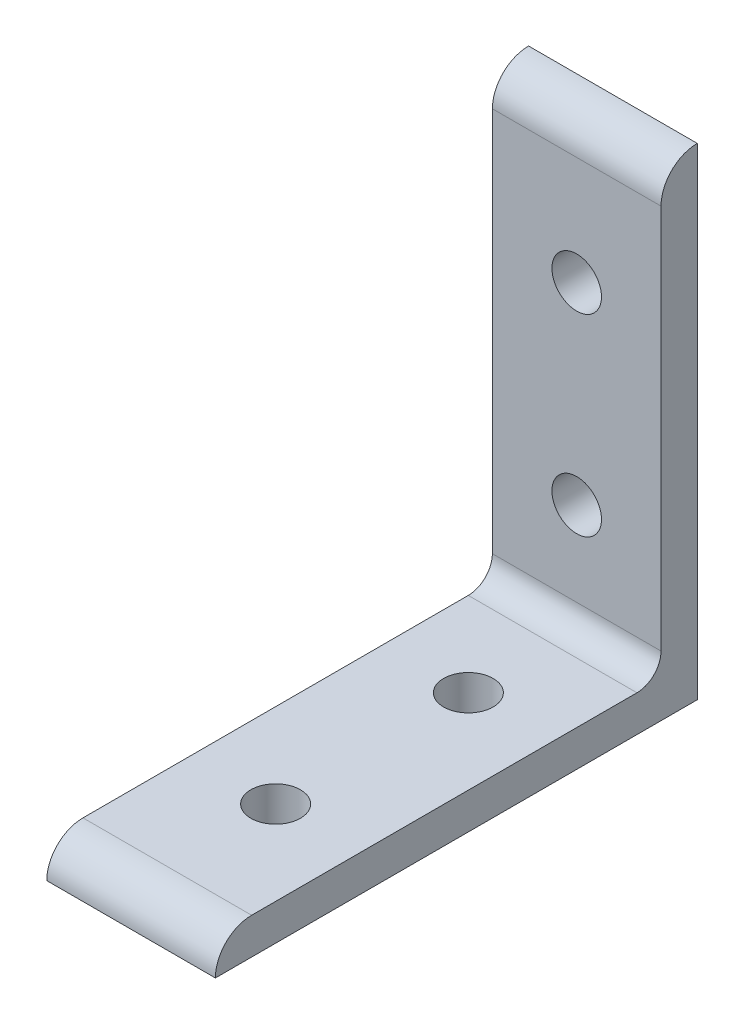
ISO-10303-21;
HEADER;
FILE_DESCRIPTION(('STEP AP214'),'2;1');
FILE_NAME('part.step','',(''),(''),'','','');
FILE_SCHEMA(('AUTOMOTIVE_DESIGN { 1 0 10303 214 1 1 1 1 }'));
ENDSEC;
DATA;
#1=APPLICATION_CONTEXT('core data for automotive mechanical design processes');
#2=APPLICATION_PROTOCOL_DEFINITION('international standard','automotive_design',2000,#1);
#3=PRODUCT_CONTEXT('',#1,'mechanical');
#4=PRODUCT('Part','Part','',(#3));
#5=PRODUCT_RELATED_PRODUCT_CATEGORY('part','',(#4));
#6=PRODUCT_DEFINITION_FORMATION('','',#4);
#7=PRODUCT_DEFINITION_CONTEXT('part definition',#1,'design');
#8=PRODUCT_DEFINITION('design','',#6,#7);
#9=PRODUCT_DEFINITION_SHAPE('','',#8);
#10=(LENGTH_UNIT() NAMED_UNIT(*) SI_UNIT(.MILLI.,.METRE.));
#11=(NAMED_UNIT(*) PLANE_ANGLE_UNIT() SI_UNIT($,.RADIAN.));
#12=(NAMED_UNIT(*) SI_UNIT($,.STERADIAN.) SOLID_ANGLE_UNIT());
#13=UNCERTAINTY_MEASURE_WITH_UNIT(LENGTH_MEASURE(1.E-05),#10,'distance_accuracy_value','');
#14=(GEOMETRIC_REPRESENTATION_CONTEXT(3) GLOBAL_UNCERTAINTY_ASSIGNED_CONTEXT((#13)) GLOBAL_UNIT_ASSIGNED_CONTEXT((#10,
#11,#12)) REPRESENTATION_CONTEXT('',''));
#15=CARTESIAN_POINT('',(0.,0.,0.));
#16=DIRECTION('',(0.,0.,1.));
#17=DIRECTION('',(1.,0.,0.));
#18=AXIS2_PLACEMENT_3D('',#15,#16,#17);
#19=CARTESIAN_POINT('',(11.1125,0.,63.5));
#20=DIRECTION('',(0.,1.,0.));
#21=DIRECTION('',(0.,0.,1.));
#22=AXIS2_PLACEMENT_3D('',#19,#20,#21);
#23=PLANE('',#22);
#24=CARTESIAN_POINT('',(0.,0.,19.05));
#25=DIRECTION('',(0.,1.,0.));
#26=DIRECTION('',(0.,0.,1.));
#27=AXIS2_PLACEMENT_3D('',#24,#25,#26);
#28=CIRCLE('',#27,3.2639);
#29=CARTESIAN_POINT('',(0.,0.,22.3139));
#30=VERTEX_POINT('',#29);
#31=EDGE_CURVE('E180',#30,#30,#28,.T.);
#32=ORIENTED_EDGE('',*,*,#31,.T.);
#33=EDGE_LOOP('',(#32));
#34=FACE_BOUND('',#33,.T.);
#35=DIRECTION('',(-1.,0.,0.));
#36=VECTOR('',#35,1.);
#37=CARTESIAN_POINT('',(11.1125,0.,63.5));
#38=LINE('',#37,#36);
#39=CARTESIAN_POINT('',(11.1125,0.,63.5));
#40=VERTEX_POINT('',#39);
#41=CARTESIAN_POINT('',(-11.1125,0.,63.5));
#42=VERTEX_POINT('',#41);
#43=EDGE_CURVE('E11',#40,#42,#38,.T.);
#44=ORIENTED_EDGE('',*,*,#43,.T.);
#45=DIRECTION('',(0.,0.,-1.));
#46=VECTOR('',#45,1.);
#47=CARTESIAN_POINT('',(-11.1125,0.,63.5));
#48=LINE('',#47,#46);
#49=CARTESIAN_POINT('',(-11.1125,0.,0.));
#50=VERTEX_POINT('',#49);
#51=EDGE_CURVE('E96',#42,#50,#48,.T.);
#52=ORIENTED_EDGE('',*,*,#51,.T.);
#53=DIRECTION('',(-1.,0.,0.));
#54=VECTOR('',#53,1.);
#55=CARTESIAN_POINT('',(11.1125,0.,0.));
#56=LINE('',#55,#54);
#57=CARTESIAN_POINT('',(11.1125,0.,0.));
#58=VERTEX_POINT('',#57);
#59=EDGE_CURVE('E43',#58,#50,#56,.T.);
#60=ORIENTED_EDGE('',*,*,#59,.F.);
#61=DIRECTION('',(0.,0.,-1.));
#62=VECTOR('',#61,1.);
#63=CARTESIAN_POINT('',(11.1125,0.,63.5));
#64=LINE('',#63,#62);
#65=EDGE_CURVE('E97',#40,#58,#64,.T.);
#66=ORIENTED_EDGE('',*,*,#65,.F.);
#67=EDGE_LOOP('',(#44,#52,#60,#66));
#68=FACE_BOUND('',#67,.T.);
#69=CARTESIAN_POINT('',(0.,0.,44.45));
#70=DIRECTION('',(0.,1.,0.));
#71=DIRECTION('',(0.,0.,1.));
#72=AXIS2_PLACEMENT_3D('',#69,#70,#71);
#73=CIRCLE('',#72,3.2639);
#74=CARTESIAN_POINT('',(0.,0.,47.7139));
#75=VERTEX_POINT('',#74);
#76=EDGE_CURVE('E181',#75,#75,#73,.T.);
#77=ORIENTED_EDGE('',*,*,#76,.T.);
#78=EDGE_LOOP('',(#77));
#79=FACE_BOUND('',#78,.T.);
#80=ADVANCED_FACE('F35',(#34,#68,#79),#23,.F.);
#81=CARTESIAN_POINT('',(11.1125,4.7752,7.9502));
#82=DIRECTION('',(0.,-1.,0.));
#83=DIRECTION('',(0.,0.,-1.));
#84=AXIS2_PLACEMENT_3D('',#81,#82,#83);
#85=PLANE('',#84);
#86=CARTESIAN_POINT('',(0.,4.7752,19.05));
#87=DIRECTION('',(0.,1.,0.));
#88=DIRECTION('',(0.,0.,1.));
#89=AXIS2_PLACEMENT_3D('',#86,#87,#88);
#90=CIRCLE('',#89,3.2639);
#91=CARTESIAN_POINT('',(0.,4.7752,22.3139));
#92=VERTEX_POINT('',#91);
#93=EDGE_CURVE('E184',#92,#92,#90,.T.);
#94=ORIENTED_EDGE('',*,*,#93,.F.);
#95=EDGE_LOOP('',(#94));
#96=FACE_BOUND('',#95,.T.);
#97=DIRECTION('',(-1.,0.,0.));
#98=VECTOR('',#97,1.);
#99=CARTESIAN_POINT('',(11.1125,4.7752,7.9502));
#100=LINE('',#99,#98);
#101=CARTESIAN_POINT('',(11.1125,4.7752,7.9502));
#102=VERTEX_POINT('',#101);
#103=CARTESIAN_POINT('',(-11.1125,4.7752,7.9502));
#104=VERTEX_POINT('',#103);
#105=EDGE_CURVE('E144',#102,#104,#100,.T.);
#106=ORIENTED_EDGE('',*,*,#105,.T.);
#107=DIRECTION('',(0.,0.,1.));
#108=VECTOR('',#107,1.);
#109=CARTESIAN_POINT('',(-11.1125,4.7752,7.9502));
#110=LINE('',#109,#108);
#111=CARTESIAN_POINT('',(-11.1125,4.7752,58.7248));
#112=VERTEX_POINT('',#111);
#113=EDGE_CURVE('E130',#104,#112,#110,.T.);
#114=ORIENTED_EDGE('',*,*,#113,.T.);
#115=DIRECTION('',(-1.,0.,0.));
#116=VECTOR('',#115,1.);
#117=CARTESIAN_POINT('',(11.1125,4.7752,58.7248));
#118=LINE('',#117,#116);
#119=CARTESIAN_POINT('',(11.1125,4.7752,58.7248));
#120=VERTEX_POINT('',#119);
#121=EDGE_CURVE('E112',#120,#112,#118,.T.);
#122=ORIENTED_EDGE('',*,*,#121,.F.);
#123=DIRECTION('',(0.,0.,1.));
#124=VECTOR('',#123,1.);
#125=CARTESIAN_POINT('',(11.1125,4.7752,7.9502));
#126=LINE('',#125,#124);
#127=EDGE_CURVE('E50',#102,#120,#126,.T.);
#128=ORIENTED_EDGE('',*,*,#127,.F.);
#129=EDGE_LOOP('',(#106,#114,#122,#128));
#130=FACE_BOUND('',#129,.T.);
#131=CARTESIAN_POINT('',(0.,4.7752,44.45));
#132=DIRECTION('',(0.,1.,0.));
#133=DIRECTION('',(0.,0.,1.));
#134=AXIS2_PLACEMENT_3D('',#131,#132,#133);
#135=CIRCLE('',#134,3.2639);
#136=CARTESIAN_POINT('',(0.,4.7752,47.7139));
#137=VERTEX_POINT('',#136);
#138=EDGE_CURVE('E178',#137,#137,#135,.T.);
#139=ORIENTED_EDGE('',*,*,#138,.F.);
#140=EDGE_LOOP('',(#139));
#141=FACE_BOUND('',#140,.T.);
#142=ADVANCED_FACE('F171',(#96,#130,#141),#85,.F.);
#143=CARTESIAN_POINT('',(11.1125,0.,0.));
#144=DIRECTION('',(0.,0.,1.));
#145=DIRECTION('',(1.,0.,0.));
#146=AXIS2_PLACEMENT_3D('',#143,#144,#145);
#147=PLANE('',#146);
#148=CARTESIAN_POINT('',(0.,19.05,0.));
#149=DIRECTION('',(0.,0.,1.));
#150=DIRECTION('',(1.,0.,0.));
#151=AXIS2_PLACEMENT_3D('',#148,#149,#150);
#152=CIRCLE('',#151,3.2639);
#153=CARTESIAN_POINT('',(3.2639,19.05,0.));
#154=VERTEX_POINT('',#153);
#155=EDGE_CURVE('E116',#154,#154,#152,.T.);
#156=ORIENTED_EDGE('',*,*,#155,.T.);
#157=EDGE_LOOP('',(#156));
#158=FACE_BOUND('',#157,.T.);
#159=ORIENTED_EDGE('',*,*,#59,.T.);
#160=DIRECTION('',(0.,1.,0.));
#161=VECTOR('',#160,1.);
#162=CARTESIAN_POINT('',(-11.1125,0.,0.));
#163=LINE('',#162,#161);
#164=CARTESIAN_POINT('',(-11.1125,63.5,0.));
#165=VERTEX_POINT('',#164);
#166=EDGE_CURVE('E110',#50,#165,#163,.T.);
#167=ORIENTED_EDGE('',*,*,#166,.T.);
#168=DIRECTION('',(-1.,0.,0.));
#169=VECTOR('',#168,1.);
#170=CARTESIAN_POINT('',(11.1125,63.5,0.));
#171=LINE('',#170,#169);
#172=CARTESIAN_POINT('',(11.1125,63.5,0.));
#173=VERTEX_POINT('',#172);
#174=EDGE_CURVE('E150',#173,#165,#171,.T.);
#175=ORIENTED_EDGE('',*,*,#174,.F.);
#176=DIRECTION('',(0.,1.,0.));
#177=VECTOR('',#176,1.);
#178=CARTESIAN_POINT('',(11.1125,0.,0.));
#179=LINE('',#178,#177);
#180=EDGE_CURVE('E135',#58,#173,#179,.T.);
#181=ORIENTED_EDGE('',*,*,#180,.F.);
#182=EDGE_LOOP('',(#159,#167,#175,#181));
#183=FACE_BOUND('',#182,.T.);
#184=CARTESIAN_POINT('',(0.,44.45,0.));
#185=DIRECTION('',(0.,0.,1.));
#186=DIRECTION('',(1.,0.,0.));
#187=AXIS2_PLACEMENT_3D('',#184,#185,#186);
#188=CIRCLE('',#187,3.2639);
#189=CARTESIAN_POINT('',(3.2639,44.45,0.));
#190=VERTEX_POINT('',#189);
#191=EDGE_CURVE('E190',#190,#190,#188,.T.);
#192=ORIENTED_EDGE('',*,*,#191,.T.);
#193=EDGE_LOOP('',(#192));
#194=FACE_BOUND('',#193,.T.);
#195=ADVANCED_FACE('F153',(#158,#183,#194),#147,.F.);
#196=CARTESIAN_POINT('',(11.1125,58.7248,4.7752));
#197=DIRECTION('',(0.,0.,-1.));
#198=DIRECTION('',(-1.,0.,0.));
#199=AXIS2_PLACEMENT_3D('',#196,#197,#198);
#200=PLANE('',#199);
#201=CARTESIAN_POINT('',(0.,19.05,4.7752));
#202=DIRECTION('',(0.,0.,1.));
#203=DIRECTION('',(1.,0.,0.));
#204=AXIS2_PLACEMENT_3D('',#201,#202,#203);
#205=CIRCLE('',#204,3.2639);
#206=CARTESIAN_POINT('',(3.2639,19.05,4.7752));
#207=VERTEX_POINT('',#206);
#208=EDGE_CURVE('E113',#207,#207,#205,.T.);
#209=ORIENTED_EDGE('',*,*,#208,.F.);
#210=EDGE_LOOP('',(#209));
#211=FACE_BOUND('',#210,.T.);
#212=DIRECTION('',(-1.,0.,0.));
#213=VECTOR('',#212,1.);
#214=CARTESIAN_POINT('',(11.1125,58.7248,4.7752));
#215=LINE('',#214,#213);
#216=CARTESIAN_POINT('',(11.1125,58.7248,4.7752));
#217=VERTEX_POINT('',#216);
#218=CARTESIAN_POINT('',(-11.1125,58.7248,4.7752));
#219=VERTEX_POINT('',#218);
#220=EDGE_CURVE('E148',#217,#219,#215,.T.);
#221=ORIENTED_EDGE('',*,*,#220,.T.);
#222=DIRECTION('',(0.,-1.,0.));
#223=VECTOR('',#222,1.);
#224=CARTESIAN_POINT('',(-11.1125,58.7248,4.7752));
#225=LINE('',#224,#223);
#226=CARTESIAN_POINT('',(-11.1125,7.9502,4.7752));
#227=VERTEX_POINT('',#226);
#228=EDGE_CURVE('E124',#219,#227,#225,.T.);
#229=ORIENTED_EDGE('',*,*,#228,.T.);
#230=DIRECTION('',(-1.,0.,0.));
#231=VECTOR('',#230,1.);
#232=CARTESIAN_POINT('',(11.1125,7.9502,4.7752));
#233=LINE('',#232,#231);
#234=CARTESIAN_POINT('',(11.1125,7.9502,4.7752));
#235=VERTEX_POINT('',#234);
#236=EDGE_CURVE('E146',#235,#227,#233,.T.);
#237=ORIENTED_EDGE('',*,*,#236,.F.);
#238=DIRECTION('',(0.,-1.,0.));
#239=VECTOR('',#238,1.);
#240=CARTESIAN_POINT('',(11.1125,58.7248,4.7752));
#241=LINE('',#240,#239);
#242=EDGE_CURVE('E139',#217,#235,#241,.T.);
#243=ORIENTED_EDGE('',*,*,#242,.F.);
#244=EDGE_LOOP('',(#221,#229,#237,#243));
#245=FACE_BOUND('',#244,.T.);
#246=CARTESIAN_POINT('',(0.,44.45,4.7752));
#247=DIRECTION('',(0.,0.,1.));
#248=DIRECTION('',(1.,0.,0.));
#249=AXIS2_PLACEMENT_3D('',#246,#247,#248);
#250=CIRCLE('',#249,3.2639);
#251=CARTESIAN_POINT('',(3.2639,44.45,4.7752));
#252=VERTEX_POINT('',#251);
#253=EDGE_CURVE('E192',#252,#252,#250,.T.);
#254=ORIENTED_EDGE('',*,*,#253,.F.);
#255=EDGE_LOOP('',(#254));
#256=FACE_BOUND('',#255,.T.);
#257=ADVANCED_FACE('F165',(#211,#245,#256),#200,.F.);
#258=CARTESIAN_POINT('',(11.1125,0.,58.7248));
#259=DIRECTION('',(-1.,0.,0.));
#260=DIRECTION('',(0.,0.,1.));
#261=AXIS2_PLACEMENT_3D('',#258,#259,#260);
#262=CYLINDRICAL_SURFACE('',#261,4.77520000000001);
#263=ORIENTED_EDGE('',*,*,#121,.T.);
#264=CARTESIAN_POINT('',(-11.1125,0.,58.7248));
#265=DIRECTION('',(1.,0.,0.));
#266=DIRECTION('',(0.,0.,-1.));
#267=AXIS2_PLACEMENT_3D('',#264,#265,#266);
#268=CIRCLE('',#267,4.77520000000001);
#269=EDGE_CURVE('E106',#112,#42,#268,.T.);
#270=ORIENTED_EDGE('',*,*,#269,.T.);
#271=ORIENTED_EDGE('',*,*,#43,.F.);
#272=CARTESIAN_POINT('',(11.1125,0.,58.7248));
#273=DIRECTION('',(1.,0.,0.));
#274=DIRECTION('',(0.,0.,-1.));
#275=AXIS2_PLACEMENT_3D('',#272,#273,#274);
#276=CIRCLE('',#275,4.77520000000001);
#277=EDGE_CURVE('E132',#120,#40,#276,.T.);
#278=ORIENTED_EDGE('',*,*,#277,.F.);
#279=EDGE_LOOP('',(#263,#270,#271,#278));
#280=FACE_BOUND('',#279,.T.);
#281=ADVANCED_FACE('F37',(#280),#262,.T.);
#282=CARTESIAN_POINT('',(11.1125,58.7248,0.));
#283=DIRECTION('',(-1.,0.,0.));
#284=DIRECTION('',(0.,0.,1.));
#285=AXIS2_PLACEMENT_3D('',#282,#283,#284);
#286=CYLINDRICAL_SURFACE('',#285,4.77520000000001);
#287=ORIENTED_EDGE('',*,*,#174,.T.);
#288=CARTESIAN_POINT('',(-11.1125,58.7248,0.));
#289=DIRECTION('',(1.,0.,0.));
#290=DIRECTION('',(0.,0.,-1.));
#291=AXIS2_PLACEMENT_3D('',#288,#289,#290);
#292=CIRCLE('',#291,4.77520000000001);
#293=EDGE_CURVE('E121',#165,#219,#292,.T.);
#294=ORIENTED_EDGE('',*,*,#293,.T.);
#295=ORIENTED_EDGE('',*,*,#220,.F.);
#296=CARTESIAN_POINT('',(11.1125,58.7248,0.));
#297=DIRECTION('',(1.,0.,0.));
#298=DIRECTION('',(0.,0.,-1.));
#299=AXIS2_PLACEMENT_3D('',#296,#297,#298);
#300=CIRCLE('',#299,4.77520000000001);
#301=EDGE_CURVE('E137',#173,#217,#300,.T.);
#302=ORIENTED_EDGE('',*,*,#301,.F.);
#303=EDGE_LOOP('',(#287,#294,#295,#302));
#304=FACE_BOUND('',#303,.T.);
#305=ADVANCED_FACE('F162',(#304),#286,.T.);
#306=CARTESIAN_POINT('',(11.1125,7.95019999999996,7.95019999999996));
#307=DIRECTION('',(-1.,0.,0.));
#308=DIRECTION('',(0.,0.,1.));
#309=AXIS2_PLACEMENT_3D('',#306,#307,#308);
#310=CYLINDRICAL_SURFACE('',#309,3.17499999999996);
#311=ORIENTED_EDGE('',*,*,#236,.T.);
#312=CARTESIAN_POINT('',(-11.1125,7.95019999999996,7.95019999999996));
#313=DIRECTION('',(-1.,0.,0.));
#314=DIRECTION('',(0.,0.,1.));
#315=AXIS2_PLACEMENT_3D('',#312,#313,#314);
#316=CIRCLE('',#315,3.17499999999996);
#317=EDGE_CURVE('E127',#227,#104,#316,.T.);
#318=ORIENTED_EDGE('',*,*,#317,.T.);
#319=ORIENTED_EDGE('',*,*,#105,.F.);
#320=CARTESIAN_POINT('',(11.1125,7.95019999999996,7.95019999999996));
#321=DIRECTION('',(-1.,0.,0.));
#322=DIRECTION('',(0.,0.,1.));
#323=AXIS2_PLACEMENT_3D('',#320,#321,#322);
#324=CIRCLE('',#323,3.17499999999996);
#325=EDGE_CURVE('E55',#235,#102,#324,.T.);
#326=ORIENTED_EDGE('',*,*,#325,.F.);
#327=EDGE_LOOP('',(#311,#318,#319,#326));
#328=FACE_BOUND('',#327,.T.);
#329=ADVANCED_FACE('F169',(#328),#310,.F.);
#330=CARTESIAN_POINT('',(11.1125,0.,58.7248));
#331=DIRECTION('',(1.,0.,0.));
#332=DIRECTION('',(0.,0.,-1.));
#333=AXIS2_PLACEMENT_3D('',#330,#331,#332);
#334=PLANE('',#333);
#335=ORIENTED_EDGE('',*,*,#277,.T.);
#336=ORIENTED_EDGE('',*,*,#65,.T.);
#337=ORIENTED_EDGE('',*,*,#180,.T.);
#338=ORIENTED_EDGE('',*,*,#301,.T.);
#339=ORIENTED_EDGE('',*,*,#242,.T.);
#340=ORIENTED_EDGE('',*,*,#325,.T.);
#341=ORIENTED_EDGE('',*,*,#127,.T.);
#342=EDGE_LOOP('',(#335,#336,#337,#338,#339,#340,#341));
#343=FACE_BOUND('',#342,.T.);
#344=ADVANCED_FACE('F157',(#343),#334,.T.);
#345=CARTESIAN_POINT('',(-11.1125,0.,58.7248));
#346=DIRECTION('',(1.,0.,0.));
#347=DIRECTION('',(0.,0.,-1.));
#348=AXIS2_PLACEMENT_3D('',#345,#346,#347);
#349=PLANE('',#348);
#350=ORIENTED_EDGE('',*,*,#269,.F.);
#351=ORIENTED_EDGE('',*,*,#113,.F.);
#352=ORIENTED_EDGE('',*,*,#317,.F.);
#353=ORIENTED_EDGE('',*,*,#228,.F.);
#354=ORIENTED_EDGE('',*,*,#293,.F.);
#355=ORIENTED_EDGE('',*,*,#166,.F.);
#356=ORIENTED_EDGE('',*,*,#51,.F.);
#357=EDGE_LOOP('',(#350,#351,#352,#353,#354,#355,#356));
#358=FACE_BOUND('',#357,.T.);
#359=ADVANCED_FACE('F104',(#358),#349,.F.);
#360=CARTESIAN_POINT('',(0.,19.05,4.7752));
#361=DIRECTION('',(0.,0.,-1.));
#362=DIRECTION('',(-1.,0.,0.));
#363=AXIS2_PLACEMENT_3D('',#360,#361,#362);
#364=CYLINDRICAL_SURFACE('',#363,3.2639);
#365=ORIENTED_EDGE('',*,*,#208,.T.);
#366=EDGE_LOOP('',(#365));
#367=FACE_BOUND('',#366,.T.);
#368=ORIENTED_EDGE('',*,*,#155,.F.);
#369=EDGE_LOOP('',(#368));
#370=FACE_BOUND('',#369,.T.);
#371=ADVANCED_FACE('F201',(#367,#370),#364,.F.);
#372=CARTESIAN_POINT('',(0.,44.45,4.7752));
#373=DIRECTION('',(0.,0.,-1.));
#374=DIRECTION('',(-1.,0.,0.));
#375=AXIS2_PLACEMENT_3D('',#372,#373,#374);
#376=CYLINDRICAL_SURFACE('',#375,3.2639);
#377=ORIENTED_EDGE('',*,*,#253,.T.);
#378=EDGE_LOOP('',(#377));
#379=FACE_BOUND('',#378,.T.);
#380=ORIENTED_EDGE('',*,*,#191,.F.);
#381=EDGE_LOOP('',(#380));
#382=FACE_BOUND('',#381,.T.);
#383=ADVANCED_FACE('F198',(#379,#382),#376,.F.);
#384=CARTESIAN_POINT('',(0.,4.7752,19.05));
#385=DIRECTION('',(0.,-1.,0.));
#386=DIRECTION('',(0.,0.,-1.));
#387=AXIS2_PLACEMENT_3D('',#384,#385,#386);
#388=CYLINDRICAL_SURFACE('',#387,3.2639);
#389=ORIENTED_EDGE('',*,*,#93,.T.);
#390=EDGE_LOOP('',(#389));
#391=FACE_BOUND('',#390,.T.);
#392=ORIENTED_EDGE('',*,*,#31,.F.);
#393=EDGE_LOOP('',(#392));
#394=FACE_BOUND('',#393,.T.);
#395=ADVANCED_FACE('F200',(#391,#394),#388,.F.);
#396=CARTESIAN_POINT('',(0.,4.7752,44.45));
#397=DIRECTION('',(0.,-1.,0.));
#398=DIRECTION('',(0.,0.,-1.));
#399=AXIS2_PLACEMENT_3D('',#396,#397,#398);
#400=CYLINDRICAL_SURFACE('',#399,3.2639);
#401=ORIENTED_EDGE('',*,*,#138,.T.);
#402=EDGE_LOOP('',(#401));
#403=FACE_BOUND('',#402,.T.);
#404=ORIENTED_EDGE('',*,*,#76,.F.);
#405=EDGE_LOOP('',(#404));
#406=FACE_BOUND('',#405,.T.);
#407=ADVANCED_FACE('F208',(#403,#406),#400,.F.);
#408=CLOSED_SHELL('',(#80,#142,#195,#257,#281,#305,#329,#344,#359,#371,#383,#395,#407));
#409=MANIFOLD_SOLID_BREP('B2',#408);
#410=ADVANCED_BREP_SHAPE_REPRESENTATION('',(#18,#409),#14);
#411=SHAPE_DEFINITION_REPRESENTATION(#9,#410);
ENDSEC;
END-ISO-10303-21;
